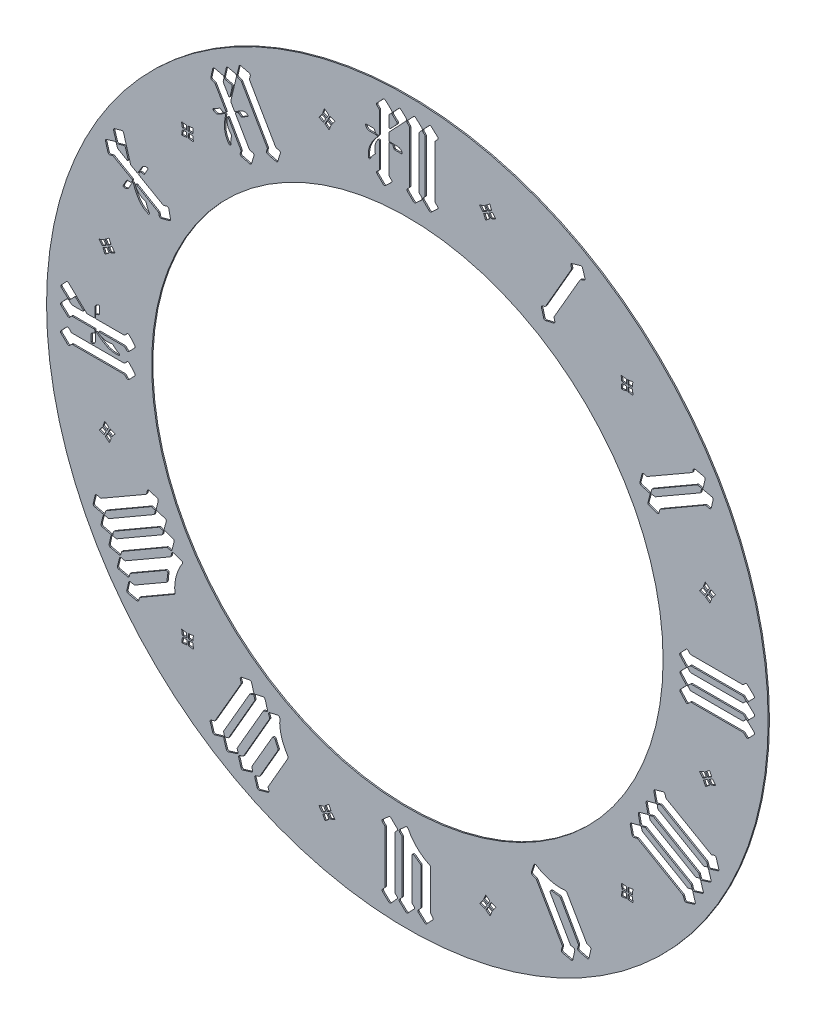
from build123d import *

# Parameters (mm, degrees)
SKETCH_2_R      = 142.5
SKETCH_2_R_2    = 101
EXTRUDE_1_DEPTH = 0.5


with BuildPart() as part:
    # Sketch 2 → Extrude 1 (new body)
    with BuildSketch(Plane.XY):
        Circle(SKETCH_2_R)
        Circle(SKETCH_2_R_2, mode=Mode.SUBTRACT)
        with BuildLine():
            Line((64.784891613, 115.462188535), (54.633225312, 97.842128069))
            ThreePointArc((54.633225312, 97.842128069), (54.460896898, 97.648808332), (54.225713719, 97.540371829))
            Line((54.225713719, 97.540371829), (53.422591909, 97.355150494))
            ThreePointArc((53.422591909, 97.355150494), (53.019703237, 97.061286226), (52.95328934, 96.567054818))
            Line((52.95328934, 96.567054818), (53.842621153, 93.352918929))
            ThreePointArc((53.842621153, 93.352918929), (54.126284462, 92.978734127), (54.589481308, 92.901741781))
            Line((54.589481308, 92.901741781), (57.750171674, 93.588649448))
            ThreePointArc((57.750171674, 93.588649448), (58.154702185, 93.874070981), (58.231353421, 94.363187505))
            Line((58.231353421, 94.363187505), (57.943178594, 95.515784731))
            ThreePointArc((57.943178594, 95.515784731), (57.93040327, 95.758236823), (58.00955213, 95.98776173))
            Line((58.00955213, 95.98776173), (68.177046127, 113.564839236))
            ThreePointArc((68.177046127, 113.564839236), (68.321134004, 113.73548853), (68.5153952, 113.845693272))
            Line((68.5153952, 113.845693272), (69.735769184, 114.276353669))
            ThreePointArc((69.735769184, 114.276353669), (70.091171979, 114.588707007), (70.131925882, 115.060103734))
            Line((70.131925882, 115.060103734), (69.188716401, 118.158225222))
            ThreePointArc((69.188716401, 118.158225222), (68.883317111, 118.531832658), (68.403479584, 118.582893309))
            Line((68.403479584, 118.582893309), (65.014635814, 117.59468894))
            ThreePointArc((65.014635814, 117.59468894), (64.633405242, 117.286323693), (64.585480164, 116.798338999))
            Line((64.585480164, 116.798338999), (64.841599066, 115.965929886))
            ThreePointArc((64.841599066, 115.965929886), (64.865692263, 115.708155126), (64.784891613, 115.462188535))
        make_face(mode=Mode.SUBTRACT)
        Polygon((89.0713, 89.1551), (87.0246, 88.8729), (87.095, 87.1088), (88.789, 87.1794), align=None, mode=Mode.SUBTRACT)
        Polygon((88.8596, 86.5443), (87.095, 86.5443), (87.095, 84.7801), (89.1419, 84.5685), align=None, mode=Mode.SUBTRACT)
        Polygon((84.4837, 84.4275), (86.5304, 84.7801), (86.4598, 86.4737), (84.6954, 86.4737), align=None, mode=Mode.SUBTRACT)
        Polygon((84.6954, 87.1088), (86.4598, 87.1088), (86.4598, 88.8729), (84.4131, 89.0845), align=None, mode=Mode.SUBTRACT)
        Polygon((32.5371, 121.7547), (30.9138, 120.4846), (31.8313, 119.0029), (33.3136, 119.8495), align=None, mode=Mode.SUBTRACT)
        Polygon((33.6665, 119.3555), (32.1136, 118.4382), (33.0313, 116.9565), (34.9369, 117.8032), align=None, mode=Mode.SUBTRACT)
        Polygon((31.6196, 118.156), (30.1375, 117.2387), (30.9138, 115.4041), (32.5371, 116.6743), align=None, mode=Mode.SUBTRACT)
        Polygon((29.7846, 117.8032), (31.3373, 118.65), (30.4198, 120.1318), (28.5142, 119.3555), align=None, mode=Mode.SUBTRACT)
        with BuildLine():
            Line((8.609940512, 136.572001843), (6.189265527, 134.009391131))
            ThreePointArc((6.189265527, 134.009391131), (6.015944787, 133.564278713), (6.201902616, 133.124295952))
            Line((6.201902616, 133.124295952), (6.871877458, 132.454426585))
            ThreePointArc((6.871877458, 132.454426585), (7.009553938, 132.248405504), (7.0579, 132.005378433))
            Line((7.0579, 132.005378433), (7.0579, 111.786321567))
            ThreePointArc((7.0579, 111.786321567), (7.009553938, 111.543294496), (6.871877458, 111.337273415))
            Line((6.871877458, 111.337273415), (6.236702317, 110.702198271))
            ThreePointArc((6.236702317, 110.702198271), (6.050679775, 110.253148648), (6.236704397, 109.804099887))
            Line((6.236704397, 109.804099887), (8.585863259, 107.455332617))
            ThreePointArc((8.585863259, 107.455332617), (9.020626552, 107.269541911), (9.46326865, 107.435690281))
            Line((9.46326865, 107.435690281), (11.880052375, 109.644862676))
            ThreePointArc((11.880052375, 109.644862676), (12.086462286, 110.099297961), (11.900661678, 110.562541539))
            Line((11.900661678, 110.562541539), (11.055160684, 111.408142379))
            ThreePointArc((11.055160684, 111.408142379), (10.917529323, 111.614142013), (10.8692, 111.857128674))
            Line((10.8692, 111.857128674), (10.8692, 132.072870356))
            ThreePointArc((10.8692, 132.072870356), (10.912800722, 132.304110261), (11.037615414, 132.503595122))
            Line((11.037615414, 132.503595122), (11.954314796, 133.496613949))
            ThreePointArc((11.954314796, 133.496613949), (12.122159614, 133.95425212), (11.916160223, 134.396031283))
            Line((11.916160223, 134.396031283), (9.499985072, 136.604647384))
            ThreePointArc((9.499985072, 136.604647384), (9.048279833, 136.770528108), (8.609940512, 136.572001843))
        make_face(mode=Mode.SUBTRACT)
        with BuildLine():
            Line((4.826766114, 132.503877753), (5.74336704, 133.496555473))
            ThreePointArc((5.74336704, 133.496555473), (5.911263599, 133.954224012), (5.705244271, 134.396044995))
            Line((5.705244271, 134.396044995), (3.288975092, 136.604568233))
            ThreePointArc((3.288975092, 136.604568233), (2.837275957, 136.770431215), (2.398949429, 136.57190542))
            Line((2.398949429, 136.57190542), (-0.021634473, 134.009391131))
            ThreePointArc((-0.021634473, 134.009391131), (-0.194955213, 133.564278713), (-0.008997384, 133.124295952))
            Line((-0.008997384, 133.124295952), (0.660977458, 132.454426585))
            ThreePointArc((0.660977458, 132.454426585), (0.798653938, 132.248405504), (0.847, 132.005378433))
            Line((0.847, 132.005378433), (0.847, 111.786321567))
            ThreePointArc((0.847, 111.786321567), (0.798653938, 111.543294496), (0.660977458, 111.337273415))
            Line((0.660977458, 111.337273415), (0.025802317, 110.702198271))
            ThreePointArc((0.025802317, 110.702198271), (-0.160220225, 110.253148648), (0.025804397, 109.804099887))
            Line((0.025804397, 109.804099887), (2.374867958, 107.455427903))
            ThreePointArc((2.374867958, 107.455427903), (2.809618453, 107.269637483), (3.252254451, 107.435768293))
            Line((3.252254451, 107.435768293), (5.669128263, 109.644844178))
            ThreePointArc((5.669128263, 109.644844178), (5.875557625, 110.099321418), (5.689703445, 110.562593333))
            Line((5.689703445, 110.562593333), (4.844313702, 111.407883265))
            ThreePointArc((4.844313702, 111.407883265), (4.70664367, 111.613901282), (4.6583, 111.856922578))
            Line((4.6583, 111.856922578), (4.6583, 132.073098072))
            ThreePointArc((4.6583, 132.073098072), (4.701914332, 132.304372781), (4.826766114, 132.503877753))
        make_face(mode=Mode.SUBTRACT)
        with BuildLine():
            Line((112.406468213, 69.805806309), (94.860870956, 59.702048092))
            ThreePointArc((94.860870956, 59.702048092), (94.631837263, 59.623435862), (94.390028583, 59.63627633))
            Line((94.390028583, 59.63627633), (93.431874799, 59.875729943))
            ThreePointArc((93.431874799, 59.875729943), (92.953997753, 59.805846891), (92.663494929, 59.420025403))
            Line((92.663494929, 59.420025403), (91.821387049, 56.193254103))
            ThreePointArc((91.821387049, 56.193254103), (91.880680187, 55.72459061), (92.247203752, 55.426561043))
            Line((92.247203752, 55.426561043), (95.403999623, 54.444634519))
            ThreePointArc((95.403999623, 54.444634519), (95.903756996, 54.497436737), (96.20863486, 54.896930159))
            Line((96.20863486, 54.896930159), (96.492988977, 56.034044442))
            ThreePointArc((96.492988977, 56.034044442), (96.601901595, 56.262168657), (96.791181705, 56.429726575))
            Line((96.791181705, 56.429726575), (114.350103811, 66.581777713))
            ThreePointArc((114.350103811, 66.581777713), (114.571329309, 66.6596543), (114.80573411, 66.651916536))
            Line((114.80573411, 66.651916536), (116.067296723, 66.371481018))
            ThreePointArc((116.067296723, 66.371481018), (116.541667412, 66.452889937), (116.822671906, 66.843647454))
            Line((116.822671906, 66.843647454), (117.586611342, 70.037864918))
            ThreePointArc((117.586611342, 70.037864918), (117.507832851, 70.52159589), (117.108087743, 70.805154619))
            Line((117.108087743, 70.805154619), (113.670719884, 71.576634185))
            ThreePointArc((113.670719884, 71.576634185), (113.193496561, 71.494514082), (112.912924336, 71.099843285))
            Line((112.912924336, 71.099843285), (112.708320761, 70.213292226))
            ThreePointArc((112.708320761, 70.213292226), (112.599836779, 69.978109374), (112.406468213, 69.805806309))
        make_face(mode=Mode.SUBTRACT)
        with BuildLine():
            Line((115.582516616, 64.442876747), (98.03692516, 54.339221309))
            ThreePointArc((98.03692516, 54.339221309), (97.807857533, 54.26060536), (97.566016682, 54.273468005))
            Line((97.566016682, 54.273468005), (96.608037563, 54.512991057))
            ThreePointArc((96.608037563, 54.512991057), (96.130122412, 54.443143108), (95.839589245, 54.057303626))
            Line((95.839589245, 54.057303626), (94.99747954, 50.830525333))
            ThreePointArc((94.99747954, 50.830525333), (95.056774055, 50.361859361), (95.423301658, 50.063830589))
            Line((95.423301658, 50.063830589), (98.579567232, 49.082099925))
            ThreePointArc((98.579567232, 49.082099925), (99.083161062, 49.137081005), (99.386278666, 49.542974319))
            Line((99.386278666, 49.542974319), (99.647139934, 50.651380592))
            ThreePointArc((99.647139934, 50.651380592), (99.755490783, 50.884548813), (99.947415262, 51.055640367))
            Line((99.947415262, 51.055640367), (117.525877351, 61.218946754))
            ThreePointArc((117.525877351, 61.218946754), (117.747055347, 61.296815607), (117.981413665, 61.28910567))
            Line((117.981413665, 61.28910567), (119.243486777, 61.008755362))
            ThreePointArc((119.243486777, 61.008755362), (119.717812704, 61.0902151), (119.998773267, 61.48096046))
            Line((119.998773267, 61.48096046), (120.762620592, 64.675204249))
            ThreePointArc((120.762620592, 64.675204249), (120.6838329, 65.158925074), (120.284092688, 65.442475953))
            Line((120.284092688, 65.442475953), (116.846731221, 66.213954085))
            ThreePointArc((116.846731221, 66.213954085), (116.369480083, 66.131816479), (116.088920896, 65.737099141))
            Line((116.088920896, 65.737099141), (115.884386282, 64.850428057))
            ThreePointArc((115.884386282, 64.850428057), (115.77590628, 64.615206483), (115.582516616, 64.442876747))
        make_face(mode=Mode.SUBTRACT)
        Polygon((117.656, 34.9634), (116.8797, 33.0582), (118.4324, 32.2115), (119.2793, 33.7639), align=None, mode=Mode.SUBTRACT)
        Polygon((118.1501, 31.7177), (116.5972, 32.5644), (115.3974, 30.8708), (117.3031, 30.1652), align=None, mode=Mode.SUBTRACT)
        Polygon((118.6441, 31.3649), (117.7972, 29.8829), (119.491, 28.6834), (120.1968, 30.518), align=None, mode=Mode.SUBTRACT)
        Polygon((118.997, 31.9293), (120.4791, 31.0826), (121.6789, 32.7054), (119.8439, 33.4817), align=None, mode=Mode.SUBTRACT)
        with BuildLine():
            Line((132.285266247, 7.3031), (111.9889233, 7.3031))
            ThreePointArc((111.9889233, 7.3031), (111.728831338, 7.358809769), (111.514376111, 7.516164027))
            Line((111.514376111, 7.516164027), (110.934058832, 8.168841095))
            ThreePointArc((110.934058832, 8.168841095), (110.468817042, 8.381836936), (109.997533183, 8.182566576))
            Line((109.997533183, 8.182566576), (107.715676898, 5.762870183))
            ThreePointArc((107.715676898, 5.762870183), (107.542677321, 5.332490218), (107.708494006, 4.899292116))
            Line((107.708494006, 4.899292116), (109.914242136, 2.480942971))
            ThreePointArc((109.914242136, 2.480942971), (110.382599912, 2.273860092), (110.851480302, 2.479756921))
            Line((110.851480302, 2.479756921), (111.591327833, 3.286802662))
            ThreePointArc((111.591327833, 3.286802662), (111.803724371, 3.438950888), (112.059404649, 3.4927))
            Line((112.059404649, 3.4927), (132.426484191, 3.4927))
            ThreePointArc((132.426484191, 3.4927), (132.669456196, 3.444376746), (132.87544805, 3.306761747))
            Line((132.87544805, 3.306761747), (133.687376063, 2.495010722))
            ThreePointArc((133.687376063, 2.495010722), (134.141074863, 2.309090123), (134.591950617, 2.501755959))
            Line((134.591950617, 2.501755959), (136.870800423, 4.84909846))
            ThreePointArc((136.870800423, 4.84909846), (137.050045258, 5.304959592), (136.851520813, 5.752761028))
            Line((136.851520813, 5.752761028), (134.291956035, 8.173541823))
            ThreePointArc((134.291956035, 8.173541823), (133.846829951, 8.347134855), (133.406682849, 8.161279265))
            Line((133.406682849, 8.161279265), (132.734208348, 7.4890165))
            ThreePointArc((132.734208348, 7.4890165), (132.528224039, 7.351417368), (132.285266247, 7.3031))
        make_face(mode=Mode.SUBTRACT)
        with BuildLine():
            Line((132.355870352, 1.0937), (112.059345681, 1.0937))
            ThreePointArc((112.059345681, 1.0937), (111.799231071, 1.149419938), (111.584765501, 1.306801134))
            Line((111.584765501, 1.306801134), (111.037041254, 1.922918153))
            ThreePointArc((111.037041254, 1.922918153), (110.57640956, 2.135866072), (110.106869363, 1.94335535))
            Line((110.106869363, 1.94335535), (107.792852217, -0.440006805))
            ThreePointArc((107.792852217, -0.440006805), (107.613609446, -0.867845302), (107.773134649, -1.303420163))
            Line((107.773134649, -1.303420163), (109.946463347, -3.756659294))
            ThreePointArc((109.946463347, -3.756659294), (110.416348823, -3.970558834), (110.889819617, -3.764717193))
            Line((110.889819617, -3.764717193), (111.662050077, -2.922464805))
            ThreePointArc((111.662050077, -2.922464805), (111.874436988, -2.770340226), (112.130097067, -2.7166))
            Line((112.130097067, -2.7166), (132.42347166, -2.7166))
            ThreePointArc((132.42347166, -2.7166), (132.654663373, -2.760181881), (132.854120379, -2.884945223))
            Line((132.854120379, -2.884945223), (133.809930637, -3.767007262))
            ThreePointArc((133.809930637, -3.767007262), (134.262621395, -3.93496981), (134.702567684, -3.736003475))
            Line((134.702567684, -3.736003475), (136.948442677, -1.354353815))
            ThreePointArc((136.948442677, -1.354353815), (137.12119454, -0.900539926), (136.922775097, -0.457346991))
            Line((136.922775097, -0.457346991), (134.362391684, 1.964099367))
            ThreePointArc((134.362391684, 1.964099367), (133.917243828, 2.137682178), (133.477093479, 1.951791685))
            Line((133.477093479, 1.951791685), (132.80484781, 1.279651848))
            ThreePointArc((132.80484781, 1.279651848), (132.59885124, 1.142026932), (132.355870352, 1.0937))
        make_face(mode=Mode.SUBTRACT)
        with BuildLine():
            Line((132.357164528, -5.1157), (112.059434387, -5.1157))
            ThreePointArc((112.059434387, -5.1157), (111.799342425, -5.059990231), (111.584887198, -4.902635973))
            Line((111.584887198, -4.902635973), (111.004703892, -4.250109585))
            ThreePointArc((111.004703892, -4.250109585), (110.539468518, -4.037113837), (110.068187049, -4.236374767))
            Line((110.068187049, -4.236374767), (107.786285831, -6.656020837))
            ThreePointArc((107.786285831, -6.656020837), (107.613277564, -7.086396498), (107.779084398, -7.519597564))
            Line((107.779084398, -7.519597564), (109.98468737, -9.937898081))
            ThreePointArc((109.98468737, -9.937898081), (110.453006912, -10.144991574), (110.921880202, -9.939154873))
            Line((110.921880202, -9.939154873), (111.662167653, -9.131837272))
            ThreePointArc((111.662167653, -9.131837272), (111.874546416, -8.979732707), (112.130189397, -8.926))
            Line((112.130189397, -8.926), (132.496889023, -8.926))
            ThreePointArc((132.496889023, -8.926), (132.739845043, -8.974316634), (132.945828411, -9.111913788))
            Line((132.945828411, -9.111913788), (133.758046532, -9.923866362))
            ThreePointArc((133.758046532, -9.923866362), (134.211738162, -10.109762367), (134.662596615, -9.91709666))
            Line((134.662596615, -9.91709666), (136.941304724, -7.569900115))
            ThreePointArc((136.941304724, -7.569900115), (137.120549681, -7.114044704), (136.922033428, -6.666245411))
            Line((136.922033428, -6.666245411), (134.328102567, -4.212873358))
            ThreePointArc((134.328102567, -4.212873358), (133.866275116, -4.039723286), (133.419824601, -4.249359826))
            Line((133.419824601, -4.249359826), (132.829103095, -4.905551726))
            ThreePointArc((132.829103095, -4.905551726), (132.615470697, -5.06078872), (132.357164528, -5.1157))
        make_face(mode=Mode.SUBTRACT)
        Polygon((117.2324, -30.0947), (115.3974, -30.9414), (116.6678, -32.4938), (118.1501, -31.6471), align=None, mode=Mode.SUBTRACT)
        Polygon((116.9501, -33.0582), (117.7972, -34.893), (119.3499, -33.6229), (118.4324, -32.1409), align=None, mode=Mode.SUBTRACT)
        Polygon((118.997, -31.8587), (119.9145, -33.3406), (121.7496, -32.4938), (120.4791, -30.9414), align=None, mode=Mode.SUBTRACT)
        Polygon((118.6441, -31.2943), (120.1968, -30.377), (119.3499, -28.5424), (117.7972, -29.8125), align=None, mode=Mode.SUBTRACT)
        with BuildLine():
            Line((119.856331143, -56.915337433), (102.2970729, -46.833558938))
            ThreePointArc((102.2970729, -46.833558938), (102.103247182, -46.661183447), (101.994520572, -46.425683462))
            Line((101.994520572, -46.425683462), (101.786267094, -45.523415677))
            ThreePointArc((101.786267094, -45.523415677), (101.490901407, -45.119729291), (100.994884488, -45.055147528))
            Line((100.994884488, -45.055147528), (97.783797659, -45.962385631))
            ThreePointArc((97.783797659, -45.962385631), (97.41201762, -46.246629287), (97.335949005, -46.708395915))
            Line((97.335949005, -46.708395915), (98.037412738, -49.934155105))
            ThreePointArc((98.037412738, -49.934155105), (98.338570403, -50.348082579), (98.847248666, -50.405339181))
            Line((98.847248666, -50.405339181), (99.870346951, -50.085745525))
            ThreePointArc((99.870346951, -50.085745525), (100.129300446, -50.060688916), (100.376568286, -50.141579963))
            Line((100.376568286, -50.141579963), (118.00332859, -60.292091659))
            ThreePointArc((118.00332859, -60.292091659), (118.185263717, -60.449429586), (118.295627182, -60.663147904))
            Line((118.295627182, -60.663147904), (118.641286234, -61.838036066))
            ThreePointArc((118.641286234, -61.838036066), (118.950735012, -62.21861867), (119.439032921, -62.265167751))
            Line((119.439032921, -62.265167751), (122.576780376, -61.289394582))
            ThreePointArc((122.576780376, -61.289394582), (122.949660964, -60.979693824), (122.995394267, -60.497135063))
            Line((122.995394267, -60.497135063), (121.962409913, -57.123298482))
            ThreePointArc((121.962409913, -57.123298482), (121.646217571, -56.744796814), (121.15449126, -56.706765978))
            Line((121.15449126, -56.706765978), (120.373252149, -56.967086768))
            ThreePointArc((120.373252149, -56.967086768), (120.109257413, -56.996493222), (119.856331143, -56.915337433))
        make_face(mode=Mode.SUBTRACT)
        with BuildLine():
            Line((97.958370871, -50.488839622), (94.681786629, -51.394935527))
            ThreePointArc((94.681786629, -51.394935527), (94.307513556, -51.678621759), (94.230538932, -52.141906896))
            Line((94.230538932, -52.141906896), (94.932008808, -55.36743611))
            ThreePointArc((94.932008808, -55.36743611), (95.233168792, -55.781355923), (95.741842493, -55.838609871))
            Line((95.741842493, -55.838609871), (96.810583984, -55.50475827))
            ThreePointArc((96.810583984, -55.50475827), (97.070084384, -55.479762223), (97.317758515, -55.561142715))
            Line((97.317758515, -55.561142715), (114.898777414, -65.725927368))
            ThreePointArc((114.898777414, -65.725927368), (115.069465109, -65.869988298), (115.179711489, -66.064239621))
            Line((115.179711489, -66.064239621), (115.617221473, -67.303334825))
            ThreePointArc((115.617221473, -67.303334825), (115.931296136, -67.659518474), (116.404591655, -67.698261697))
            Line((116.404591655, -67.698261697), (119.541929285, -66.722418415))
            ThreePointArc((119.541929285, -66.722418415), (119.914791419, -66.41269752), (119.960498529, -65.930137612))
            Line((119.960498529, -65.930137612), (118.927409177, -62.556595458))
            ThreePointArc((118.927409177, -62.556595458), (118.611221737, -62.178123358), (118.119521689, -62.140087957))
            Line((118.119521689, -62.140087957), (117.338336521, -62.40036004))
            ThreePointArc((117.338336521, -62.40036004), (117.073949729, -62.429717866), (116.820735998, -62.348200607))
            Line((116.820735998, -62.348200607), (99.178292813, -52.188772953))
            ThreePointArc((99.178292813, -52.188772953), (98.971236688, -51.997258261), (98.86754538, -51.734964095))
            Line((98.86754538, -51.734964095), (98.755248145, -51.004394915))
            ThreePointArc((98.755248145, -51.004394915), (98.472550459, -50.567720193), (97.958370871, -50.488839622))
        make_face(mode=Mode.SUBTRACT)
        with BuildLine():
            Line((95.75521403, -57.053033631), (95.649561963, -56.367005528))
            ThreePointArc((95.649561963, -56.367005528), (95.36533146, -55.92950437), (94.849311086, -55.852580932))
            Line((94.849311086, -55.852580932), (91.643318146, -56.758379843))
            ThreePointArc((91.643318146, -56.758379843), (91.271538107, -57.042623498), (91.195469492, -57.504390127))
            Line((91.195469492, -57.504390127), (91.878981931, -60.647598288))
            ThreePointArc((91.878981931, -60.647598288), (92.164391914, -61.05205573), (92.65343924, -61.128719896))
            Line((92.65343924, -61.128719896), (93.739871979, -60.857207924))
            ThreePointArc((93.739871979, -60.857207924), (93.981680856, -60.844367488), (94.210714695, -60.922979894))
            Line((94.210714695, -60.922979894), (111.86282859, -71.088091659))
            ThreePointArc((111.86282859, -71.088091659), (112.044763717, -71.245429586), (112.155127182, -71.459147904))
            Line((112.155127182, -71.459147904), (112.500786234, -72.634036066))
            ThreePointArc((112.500786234, -72.634036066), (112.810235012, -73.01461867), (113.298532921, -73.061167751))
            Line((113.298532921, -73.061167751), (116.436460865, -72.085338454))
            ThreePointArc((116.436460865, -72.085338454), (116.809345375, -71.775630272), (116.855069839, -71.293062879))
            Line((116.855069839, -71.293062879), (115.821995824, -67.919252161))
            ThreePointArc((115.821995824, -67.919252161), (115.505800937, -67.540762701), (115.014082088, -67.502735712))
            Line((115.014082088, -67.502735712), (114.23282797, -67.763061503))
            ThreePointArc((114.23282797, -67.763061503), (113.967882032, -67.792372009), (113.714250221, -67.710357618))
            Line((113.714250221, -67.710357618), (96.064977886, -57.506111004))
            ThreePointArc((96.064977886, -57.506111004), (95.858617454, -57.314767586), (95.75521403, -57.053033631))
        make_face(mode=Mode.SUBTRACT)
        with BuildLine():
            Line((111.922299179, -72.789738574), (111.089295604, -73.046040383))
            ThreePointArc((111.089295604, -73.046040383), (110.831586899, -73.070141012), (110.585669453, -72.989399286))
            Line((110.585669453, -72.989399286), (92.961178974, -62.840094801))
            ThreePointArc((92.961178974, -62.840094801), (92.767851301, -62.667844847), (92.659358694, -62.43273851))
            Line((92.659358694, -62.43273851), (92.473869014, -61.629766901))
            ThreePointArc((92.473869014, -61.629766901), (92.180002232, -61.227067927), (91.685923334, -61.160658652))
            Line((91.685923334, -61.160658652), (88.470675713, -62.049739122))
            ThreePointArc((88.470675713, -62.049739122), (88.096395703, -62.333423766), (88.019418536, -62.796713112))
            Line((88.019418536, -62.796713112), (88.706576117, -65.956430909))
            ThreePointArc((88.706576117, -65.956430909), (88.99201082, -66.360894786), (89.481082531, -66.437529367))
            Line((89.481082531, -66.437529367), (90.634424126, -66.149193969))
            ThreePointArc((90.634424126, -66.149193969), (90.87680596, -66.136413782), (91.106276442, -66.215506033))
            Line((91.106276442, -66.215506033), (108.687592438, -76.38067818))
            ThreePointArc((108.687592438, -76.38067818), (108.858266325, -76.524725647), (108.96851039, -76.718956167))
            Line((108.96851039, -76.718956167), (109.399403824, -77.939108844))
            ThreePointArc((109.399403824, -77.939108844), (109.711730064, -78.294386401), (110.183012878, -78.335158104))
            Line((110.183012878, -78.335158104), (113.28229562, -77.392113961))
            ThreePointArc((113.28229562, -77.392113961), (113.655992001, -77.08669399), (113.707034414, -76.606772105))
            Line((113.707034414, -76.606772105), (112.718626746, -73.218817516))
            ThreePointArc((112.718626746, -73.218817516), (112.410248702, -72.8376447), (111.922299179, -72.789738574))
        make_face(mode=Mode.SUBTRACT)
        Polygon((86.4598, -84.7097), (84.4837, -84.4979), (84.766, -86.4737), (86.5304, -86.4737), align=None, mode=Mode.SUBTRACT)
        Polygon((86.5304, -87.0381), (84.766, -87.1088), (84.5542, -89.0845), (86.5304, -88.8023), align=None, mode=Mode.SUBTRACT)
        Polygon((87.1656, -88.8023), (89.1419, -89.0139), (88.8596, -87.0381), (87.095, -87.0381), align=None, mode=Mode.SUBTRACT)
        Polygon((87.095, -86.4033), (88.8596, -86.4033), (89.0713, -84.3569), (87.095, -84.7097), align=None, mode=Mode.SUBTRACT)
        Polygon((32.5371, -116.6036), (30.9138, -115.4041), (30.1375, -117.2387), (31.6902, -118.0856), align=None, mode=Mode.SUBTRACT)
        Polygon((29.8552, -117.8034), (28.6552, -119.4263), (30.5609, -120.2024), (31.4079, -118.65), align=None, mode=Mode.SUBTRACT)
        Polygon((31.9019, -118.9323), (31.055, -120.4846), (32.6784, -121.6841), (33.4546, -119.7789), align=None, mode=Mode.SUBTRACT)
        Polygon((32.1842, -118.4384), (33.7369, -119.2851), (34.9369, -117.5915), (33.0313, -116.8859), align=None, mode=Mode.SUBTRACT)
        Polygon((-30.9844, -115.3335), (-32.5371, -116.6036), (-31.6196, -118.1562), (-30.1375, -117.2387), align=None, mode=Mode.SUBTRACT)
        Polygon((-33.1017, -116.9565), (-34.9367, -117.7327), (-33.6663, -119.3557), (-32.1842, -118.4384), align=None, mode=Mode.SUBTRACT)
        Polygon((-31.8313, -118.9323), (-33.384, -119.8495), (-32.5371, -121.7547), (-30.9844, -120.4846), align=None, mode=Mode.SUBTRACT)
        Polygon((-31.3373, -118.65), (-30.4198, -120.1318), (-28.5846, -119.3557), (-29.855, -117.7327), align=None, mode=Mode.SUBTRACT)
        Polygon((-87.1656, -84.7803), (-89.1419, -84.4979), (-88.8596, -86.5443), (-87.095, -86.4737), align=None, mode=Mode.SUBTRACT)
        Polygon((-88.8596, -87.1088), (-89.0713, -89.1551), (-87.095, -88.8729), (-87.095, -87.1088), align=None, mode=Mode.SUBTRACT)
        Polygon((-86.4598, -87.1088), (-86.4598, -88.8729), (-84.4131, -89.0845), (-84.766, -87.0381), align=None, mode=Mode.SUBTRACT)
        Polygon((-86.4598, -86.4737), (-84.766, -86.4737), (-84.4835, -84.4275), (-86.5304, -84.7097), align=None, mode=Mode.SUBTRACT)
        Polygon((-118.7147, -31.3649), (-117.8676, -29.8125), (-119.491, -28.6128), (-120.1968, -30.518), align=None, mode=Mode.SUBTRACT)
        Polygon((-117.3031, -30.1654), (-118.1499, -31.6471), (-116.6678, -32.4938), (-115.3974, -30.8708), align=None, mode=Mode.SUBTRACT)
        Polygon((-119.8439, -33.411), (-118.997, -31.9293), (-120.5498, -31.0826), (-121.7496, -32.7056), align=None, mode=Mode.SUBTRACT)
        Polygon((-118.4324, -32.2115), (-119.2793, -33.6933), (-117.656, -34.9634), (-116.9501, -33.0582), align=None, mode=Mode.SUBTRACT)
        Polygon((-120.4791, 30.9414), (-118.997, 31.8587), (-119.9145, 33.3404), (-121.7496, 32.5644), align=None, mode=Mode.SUBTRACT)
        Polygon((-118.7147, 31.2943), (-120.1968, 30.4476), (-119.4204, 28.5424), (-117.7972, 29.8125), align=None, mode=Mode.SUBTRACT)
        Polygon((-118.1499, 31.6471), (-117.3031, 30.1652), (-115.3974, 30.9414), (-116.6678, 32.5644), align=None, mode=Mode.SUBTRACT)
        Polygon((-118.5029, 32.1409), (-117.0208, 33.0582), (-117.7972, 34.893), (-119.4204, 33.6933), align=None, mode=Mode.SUBTRACT)
        Polygon((-87.1656, 88.8023), (-89.2125, 89.0139), (-88.8596, 87.0381), (-87.1656, 87.0381), align=None, mode=Mode.SUBTRACT)
        Polygon((-88.8596, 86.4031), (-89.1419, 84.4275), (-87.095, 84.7097), (-87.1656, 86.4737), align=None, mode=Mode.SUBTRACT)
        Polygon((-86.6011, 88.8023), (-86.5304, 87.1088), (-84.766, 87.1088), (-84.5542, 89.1551), align=None, mode=Mode.SUBTRACT)
        Polygon((-86.5304, 86.4737), (-86.4598, 84.7097), (-84.4835, 84.4979), (-84.766, 86.4737), align=None, mode=Mode.SUBTRACT)
        Polygon((-31.055, 120.4846), (-32.7488, 121.6841), (-33.4546, 119.7789), (-31.9019, 118.9323), align=None, mode=Mode.SUBTRACT)
        Polygon((-33.7369, 119.2851), (-34.9367, 117.6621), (-33.1017, 116.8859), (-32.2548, 118.4382), align=None, mode=Mode.SUBTRACT)
        Polygon((-31.6902, 118.156), (-32.5371, 116.6036), (-30.9138, 115.4041), (-30.1375, 117.3093), align=None, mode=Mode.SUBTRACT)
        Polygon((-31.4079, 118.65), (-29.855, 117.8032), (-28.6552, 119.4261), (-30.5609, 120.2024), align=None, mode=Mode.SUBTRACT)
        with BuildLine():
            Line((-65.564338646, 114.621051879), (-55.398791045, 97.047539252))
            ThreePointArc((-55.398791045, 97.047539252), (-55.316712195, 96.793834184), (-55.34603221, 96.528799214))
            Line((-55.34603221, 96.528799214), (-55.605988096, 95.748839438))
            ThreePointArc((-55.605988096, 95.748839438), (-55.560956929, 95.243849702), (-55.160608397, 94.932781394))
            Line((-55.160608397, 94.932781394), (-51.92821292, 94.107752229))
            ThreePointArc((-51.92821292, 94.107752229), (-51.461398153, 94.168711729), (-51.164849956, 94.534349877))
            Line((-51.164849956, 94.534349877), (-50.18809123, 97.673204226))
            ThreePointArc((-50.18809123, 97.673204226), (-50.240878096, 98.17304727), (-50.640466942, 98.477937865))
            Line((-50.640466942, 98.477937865), (-51.695248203, 98.741516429))
            ThreePointArc((-51.695248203, 98.741516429), (-51.923378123, 98.850381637), (-52.090964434, 99.039616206))
            Line((-52.090964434, 99.039616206), (-62.25765899, 116.615111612))
            ThreePointArc((-62.25765899, 116.615111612), (-62.336181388, 116.840282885), (-62.326109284, 117.078539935))
            Line((-62.326109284, 117.078539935), (-62.037660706, 118.304165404))
            ThreePointArc((-62.037660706, 118.304165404), (-62.115246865, 118.782888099), (-62.508113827, 119.067230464))
            Line((-62.508113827, 119.067230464), (-65.718258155, 119.83473825))
            ThreePointArc((-65.718258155, 119.83473825), (-66.196712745, 119.759177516), (-66.48268448, 119.368219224))
            Line((-66.48268448, 119.368219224), (-67.33309271, 115.896396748))
            ThreePointArc((-67.33309271, 115.896396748), (-67.257023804, 115.412349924), (-66.859013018, 115.126561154))
            Line((-66.859013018, 115.126561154), (-65.971313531, 114.921856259))
            ThreePointArc((-65.971313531, 114.921856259), (-65.736565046, 114.813748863), (-65.564338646, 114.621051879))
        make_face(mode=Mode.SUBTRACT)
        with BuildLine():
            Line((-111.988804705, -4.904), (-132.355889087, -4.904))
            ThreePointArc((-132.355889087, -4.904), (-132.598845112, -4.855683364), (-132.804828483, -4.718086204))
            Line((-132.804828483, -4.718086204), (-133.651164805, -3.872026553))
            ThreePointArc((-133.651164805, -3.872026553), (-134.109455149, -3.686181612), (-134.562073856, -3.885441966))
            Line((-134.562073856, -3.885441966), (-136.807421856, -6.266328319))
            ThreePointArc((-136.807421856, -6.266328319), (-136.980192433, -6.720160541), (-136.781755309, -7.163371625))
            Line((-136.781755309, -7.163371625), (-134.221278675, -9.584720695))
            ThreePointArc((-134.221278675, -9.584720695), (-133.776136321, -9.758286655), (-133.335998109, -9.572396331))
            Line((-133.335998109, -9.572396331), (-132.66384781, -8.900351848))
            ThreePointArc((-132.66384781, -8.900351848), (-132.45785124, -8.762726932), (-132.214870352, -8.7144))
            Line((-132.214870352, -8.7144), (-111.990129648, -8.7144))
            ThreePointArc((-111.990129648, -8.7144), (-111.74714876, -8.762726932), (-111.54115219, -8.900351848))
            Line((-111.54115219, -8.900351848), (-110.87043174, -9.570966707))
            ThreePointArc((-110.87043174, -9.570966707), (-110.416728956, -9.756900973), (-109.965843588, -9.564235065))
            Line((-109.965843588, -9.564235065), (-107.651832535, -7.180674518))
            ThreePointArc((-107.651832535, -7.180674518), (-107.4726086, -6.752849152), (-107.632124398, -6.317291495))
            Line((-107.632124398, -6.317291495), (-109.805353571, -3.864052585))
            ThreePointArc((-109.805353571, -3.864052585), (-110.275261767, -3.650142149), (-110.748746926, -3.856013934))
            Line((-110.748746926, -3.856013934), (-111.520730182, -4.698105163))
            ThreePointArc((-111.520730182, -4.698105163), (-111.733125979, -4.850251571), (-111.988804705, -4.904))
        make_face(mode=Mode.SUBTRACT)
        with BuildLine():
            Line((-103.285288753, -45.493087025), (-120.892630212, -55.632301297))
            ThreePointArc((-120.892630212, -55.632301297), (-121.129841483, -55.712000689), (-121.379425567, -55.693863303))
            Line((-121.379425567, -55.693863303), (-122.513188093, -55.379008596))
            ThreePointArc((-122.513188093, -55.379008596), (-123.005508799, -55.443789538), (-123.300674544, -55.843105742))
            Line((-123.300674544, -55.843105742), (-124.067820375, -59.049706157))
            ThreePointArc((-124.067820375, -59.049706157), (-123.991523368, -59.529487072), (-123.598413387, -59.814926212))
            Line((-123.598413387, -59.814926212), (-120.18850327, -60.63315004))
            ThreePointArc((-120.18850327, -60.63315004), (-119.711064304, -60.55863621), (-119.424301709, -60.169704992))
            Line((-119.424301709, -60.169704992), (-119.197918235, -59.264278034))
            ThreePointArc((-119.197918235, -59.264278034), (-119.089006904, -59.036141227), (-118.899720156, -58.868574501))
            Line((-118.899720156, -58.868574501), (-101.34057123, -48.716392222))
            ThreePointArc((-101.34057123, -48.716392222), (-101.094247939, -48.635162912), (-100.835993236, -48.659201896))
            Line((-100.835993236, -48.659201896), (-99.958718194, -48.929125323))
            ThreePointArc((-99.958718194, -48.929125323), (-99.455805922, -48.872894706), (-99.153690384, -48.466928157))
            Line((-99.153690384, -48.466928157), (-98.397316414, -45.235555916))
            ThreePointArc((-98.397316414, -45.235555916), (-98.463419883, -44.777276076), (-98.823113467, -44.485710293))
            Line((-98.823113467, -44.485710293), (-101.893407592, -43.50904119))
            ThreePointArc((-101.893407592, -43.50904119), (-102.395285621, -43.559631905), (-102.701935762, -43.960139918))
            Line((-102.701935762, -43.960139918), (-102.98613272, -45.096827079))
            ThreePointArc((-102.98613272, -45.096827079), (-103.095376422, -45.325407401), (-103.285288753, -45.493087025))
        make_face(mode=Mode.SUBTRACT)
        with BuildLine():
            Line((-100.158249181, -50.843497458), (-117.737958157, -61.007566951))
            ThreePointArc((-117.737958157, -61.007566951), (-117.963061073, -61.08602817), (-118.20123339, -61.075956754))
            Line((-118.20123339, -61.075956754), (-119.427702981, -60.787381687))
            ThreePointArc((-119.427702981, -60.787381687), (-119.906367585, -60.864961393), (-120.190712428, -61.257754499))
            Line((-120.190712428, -61.257754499), (-120.958475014, -64.466932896))
            ThreePointArc((-120.958475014, -64.466932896), (-120.882936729, -64.945473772), (-120.491893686, -65.231468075))
            Line((-120.491893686, -65.231468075), (-117.018912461, -66.081662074))
            ThreePointArc((-117.018912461, -66.081662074), (-116.515136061, -65.992859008), (-116.240303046, -65.561415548))
            Line((-116.240303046, -65.561415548), (-116.124358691, -64.807653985))
            ThreePointArc((-116.124358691, -64.807653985), (-116.020970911, -64.54585529), (-115.814579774, -64.354464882))
            Line((-115.814579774, -64.354464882), (-98.165356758, -54.150146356))
            ThreePointArc((-98.165356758, -54.150146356), (-97.91169038, -54.068127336), (-97.646712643, -54.097462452))
            Line((-97.646712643, -54.097462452), (-96.866472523, -54.357542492))
            ThreePointArc((-96.866472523, -54.357542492), (-96.361503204, -54.312541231), (-96.050411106, -53.912240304))
            Line((-96.050411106, -53.912240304), (-95.225240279, -50.68083276))
            ThreePointArc((-95.225240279, -50.68083276), (-95.286184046, -50.213943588), (-95.651898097, -49.917375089))
            Line((-95.651898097, -49.917375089), (-98.791800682, -48.940734))
            ThreePointArc((-98.791800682, -48.940734), (-99.291589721, -48.993558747), (-99.596449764, -49.393108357))
            Line((-99.596449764, -49.393108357), (-99.860037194, -50.447738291))
            ThreePointArc((-99.860037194, -50.447738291), (-99.968945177, -50.675907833), (-100.158249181, -50.843497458))
        make_face(mode=Mode.SUBTRACT)
        with BuildLine():
            Line((-96.40428605, -54.691546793), (-96.672115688, -55.762770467))
            ThreePointArc((-96.672115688, -55.762770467), (-96.78102629, -55.990909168), (-96.970313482, -56.158477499))
            Line((-96.970313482, -56.158477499), (-114.612476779, -66.35871428))
            ThreePointArc((-114.612476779, -66.35871428), (-114.833679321, -66.436587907), (-115.068061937, -66.42886422))
            Line((-115.068061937, -66.42886422), (-116.34481194, -66.145153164))
            ThreePointArc((-116.34481194, -66.145153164), (-116.825878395, -66.23084601), (-117.103648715, -66.63285577))
            Line((-117.103648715, -66.63285577), (-117.790451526, -69.86008944))
            ThreePointArc((-117.790451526, -69.86008944), (-117.703915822, -70.335013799), (-117.308436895, -70.611849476))
            Line((-117.308436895, -70.611849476), (-113.885823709, -71.380116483))
            ThreePointArc((-113.885823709, -71.380116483), (-113.408562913, -71.297987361), (-113.127996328, -70.903265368))
            Line((-113.127996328, -70.903265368), (-112.938762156, -70.082922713))
            ThreePointArc((-112.938762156, -70.082922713), (-112.830610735, -69.848145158), (-112.637849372, -69.675923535))
            Line((-112.637849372, -69.675923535), (-95.059888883, -59.512864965))
            ThreePointArc((-95.059888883, -59.512864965), (-94.806245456, -59.430848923), (-94.541288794, -59.460167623))
            Line((-94.541288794, -59.460167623), (-93.760920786, -59.720228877))
            ThreePointArc((-93.760920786, -59.720228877), (-93.255990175, -59.675211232), (-92.944910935, -59.274947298))
            Line((-92.944910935, -59.274947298), (-92.119492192, -56.04333207))
            ThreePointArc((-92.119492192, -56.04333207), (-92.176303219, -55.583905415), (-92.529904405, -55.28513034))
            Line((-92.529904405, -55.28513034), (-95.583413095, -54.244514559))
            ThreePointArc((-95.583413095, -54.244514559), (-96.09194458, -54.287901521), (-96.40428605, -54.691546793))
        make_face(mode=Mode.SUBTRACT)
        with BuildLine():
            Line((-111.751000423, -72.285557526), (-112.961752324, -72.016607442))
            ThreePointArc((-112.961752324, -72.016607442), (-113.436054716, -72.098052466), (-113.717025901, -72.488758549))
            Line((-113.717025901, -72.488758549), (-114.484687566, -75.697712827))
            ThreePointArc((-114.484687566, -75.697712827), (-114.405198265, -76.182630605), (-114.003486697, -76.465635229))
            Line((-114.003486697, -76.465635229), (-110.562508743, -77.222279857))
            ThreePointArc((-110.562508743, -77.222279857), (-110.086863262, -77.138864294), (-109.807428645, -76.745020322))
            Line((-109.807428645, -76.745020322), (-109.621324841, -75.939390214))
            ThreePointArc((-109.621324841, -75.939390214), (-109.512907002, -75.70438481), (-109.319722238, -75.532159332))
            Line((-109.319722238, -75.532159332), (-95.551745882, -67.596426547))
            ThreePointArc((-95.551745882, -67.596426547), (-94.869307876, -67.627200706), (-94.609685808, -68.259074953))
            ThreePointArc((-94.609685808, -68.259074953), (-94.809976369, -69.628666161), (-94.919824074, -71.008459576))
            ThreePointArc((-94.919824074, -71.008459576), (-95.011791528, -71.309188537), (-95.23677565, -71.528911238))
            Line((-95.23677565, -71.528911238), (-107.575267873, -78.648363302))
            ThreePointArc((-107.575267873, -78.648363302), (-107.800141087, -78.726585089), (-108.038016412, -78.716488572))
            Line((-108.038016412, -78.716488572), (-109.280404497, -78.424271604))
            ThreePointArc((-109.280404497, -78.424271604), (-109.759045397, -78.501878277), (-110.043367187, -78.894664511))
            Line((-110.043367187, -78.894664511), (-110.811138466, -82.104076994))
            ThreePointArc((-110.811138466, -82.104076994), (-110.732369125, -82.587843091), (-110.332589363, -82.871410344))
            Line((-110.332589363, -82.871410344), (-106.827862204, -83.657805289))
            ThreePointArc((-106.827862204, -83.657805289), (-106.350658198, -83.57566822), (-106.070100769, -83.181006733))
            Line((-106.070100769, -83.181006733), (-105.862000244, -82.279303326))
            ThreePointArc((-105.862000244, -82.279303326), (-105.753933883, -82.044684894), (-105.56136382, -81.872519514))
            Line((-105.56136382, -81.872519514), (-92.143421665, -74.10613831))
            ThreePointArc((-92.143421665, -74.10613831), (-91.898550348, -73.850308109), (-91.8287743, -73.503116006))
            ThreePointArc((-91.8287743, -73.503116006), (-91.327966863, -67.51502903), (-88.884089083, -62.025452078))
            ThreePointArc((-88.884089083, -62.025452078), (-88.813910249, -61.463343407), (-89.220457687, -61.068868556))
            Line((-89.220457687, -61.068868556), (-92.278205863, -60.096159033))
            ThreePointArc((-92.278205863, -60.096159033), (-92.780098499, -60.146752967), (-93.086746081, -60.547281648))
            Line((-93.086746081, -60.547281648), (-93.366632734, -61.666927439))
            ThreePointArc((-93.366632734, -61.666927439), (-93.475873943, -61.895521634), (-93.665792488, -62.063211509))
            Line((-93.665792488, -62.063211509), (-111.296417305, -72.215948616))
            ThreePointArc((-111.296417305, -72.215948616), (-111.517185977, -72.293350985), (-111.751000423, -72.285557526))
        make_face(mode=Mode.SUBTRACT)
        with BuildLine():
            Line((-65.703068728, -91.542909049), (-75.870342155, -109.119605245))
            ThreePointArc((-75.870342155, -109.119605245), (-76.027595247, -109.300889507), (-76.240896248, -109.410867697))
            Line((-76.240896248, -109.410867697), (-77.416099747, -109.756377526))
            ThreePointArc((-77.416099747, -109.756377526), (-77.795872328, -110.064138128), (-77.844461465, -110.550536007))
            Line((-77.844461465, -110.550536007), (-76.887403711, -113.694144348))
            ThreePointArc((-76.887403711, -113.694144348), (-76.583537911, -114.066919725), (-76.105519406, -114.119780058))
            Line((-76.105519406, -114.119780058), (-72.711210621, -113.150187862))
            ThreePointArc((-72.711210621, -113.150187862), (-72.327448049, -112.842372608), (-72.278713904, -112.352833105))
            Line((-72.278713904, -112.352833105), (-72.548927, -111.474808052))
            ThreePointArc((-72.548927, -111.474808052), (-72.572971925, -111.216467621), (-72.49167973, -110.97007461))
            Line((-72.49167973, -110.97007461), (-62.325694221, -93.395777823))
            ThreePointArc((-62.325694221, -93.395777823), (-62.153473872, -93.203085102), (-61.918733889, -93.094976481))
            Line((-61.918733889, -93.094976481), (-61.097433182, -92.905562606))
            ThreePointArc((-61.097433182, -92.905562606), (-60.693639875, -92.610174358), (-60.62908537, -92.114053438))
            Line((-60.62908537, -92.114053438), (-61.536577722, -88.904105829))
            ThreePointArc((-61.536577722, -88.904105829), (-61.820804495, -88.532420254), (-62.282483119, -88.456342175))
            Line((-62.282483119, -88.456342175), (-65.509299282, -89.157620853))
            ThreePointArc((-65.509299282, -89.157620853), (-65.923321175, -89.458826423), (-65.980514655, -89.967616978))
            Line((-65.980514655, -89.967616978), (-65.646661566, -91.035473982))
            ThreePointArc((-65.646661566, -91.035473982), (-65.621619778, -91.295110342), (-65.703068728, -91.542909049))
        make_face(mode=Mode.SUBTRACT)
        with BuildLine():
            Line((-60.338132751, -94.575786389), (-70.505635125, -112.223306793))
            ThreePointArc((-70.505635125, -112.223306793), (-70.663005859, -112.405203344), (-70.876738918, -112.515521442))
            Line((-70.876738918, -112.515521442), (-72.052050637, -112.861063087))
            ThreePointArc((-72.052050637, -112.861063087), (-72.43275252, -113.170552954), (-72.479257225, -113.658974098))
            Line((-72.479257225, -113.658974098), (-71.49698451, -116.815228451))
            ThreePointArc((-71.49698451, -116.815228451), (-71.185676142, -117.188846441), (-70.701336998, -117.232651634))
            Line((-70.701336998, -117.232651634), (-67.332694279, -116.180398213))
            ThreePointArc((-67.332694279, -116.180398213), (-66.956770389, -115.863610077), (-66.919633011, -115.373411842))
            Line((-66.919633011, -115.373411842), (-67.179899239, -114.592889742))
            ThreePointArc((-67.179899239, -114.592889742), (-67.20925227, -114.327814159), (-67.127168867, -114.074064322))
            Line((-67.127168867, -114.074064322), (-56.920413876, -96.429315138))
            ThreePointArc((-56.920413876, -96.429315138), (-56.729054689, -96.223016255), (-56.467338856, -96.119660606))
            Line((-56.467338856, -96.119660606), (-55.780847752, -96.014012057))
            ThreePointArc((-55.780847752, -96.014012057), (-55.34326739, -95.729752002), (-55.266387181, -95.213641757))
            Line((-55.266387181, -95.213641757), (-56.172485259, -92.008777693))
            ThreePointArc((-56.172485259, -92.008777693), (-56.456713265, -91.637097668), (-56.918388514, -91.561021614))
            Line((-56.918388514, -91.561021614), (-60.062664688, -92.244362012))
            ThreePointArc((-60.062664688, -92.244362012), (-60.467202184, -92.529794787), (-60.543840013, -93.01892575))
            Line((-60.543840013, -93.01892575), (-60.272315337, -94.104735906))
            ThreePointArc((-60.272315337, -94.104735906), (-60.259455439, -94.346656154), (-60.338132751, -94.575786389))
        make_face(mode=Mode.SUBTRACT)
        with BuildLine():
            Line((-51.167569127, -94.95639569), (-54.289971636, -95.649869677))
            ThreePointArc((-54.289971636, -95.649869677), (-54.701905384, -95.951718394), (-54.758356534, -96.459276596))
            Line((-54.758356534, -96.459276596), (-54.438771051, -97.481316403))
            ThreePointArc((-54.438771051, -97.481316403), (-54.413657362, -97.740420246), (-54.494618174, -97.987828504))
            Line((-54.494618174, -97.987828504), (-64.64748067, -115.610038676))
            ThreePointArc((-64.64748067, -115.610038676), (-64.808661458, -115.794912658), (-65.027882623, -115.904911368))
            Line((-65.027882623, -115.904911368), (-66.190183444, -116.227483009))
            ThreePointArc((-66.190183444, -116.227483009), (-66.574750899, -116.529698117), (-66.630414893, -117.015627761))
            Line((-66.630414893, -117.015627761), (-65.713202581, -120.189932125))
            ThreePointArc((-65.713202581, -120.189932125), (-65.403871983, -120.572942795), (-64.913779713, -120.619763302))
            Line((-64.913779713, -120.619763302), (-61.545074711, -119.567198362))
            ThreePointArc((-61.545074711, -119.567198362), (-61.169187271, -119.250402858), (-61.132061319, -118.760226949))
            Line((-61.132061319, -118.760226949), (-61.392297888, -117.979793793))
            ThreePointArc((-61.392297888, -117.979793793), (-61.421622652, -117.714440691), (-61.339287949, -117.460485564))
            Line((-61.339287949, -117.460485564), (-53.367294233, -103.706934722))
            ThreePointArc((-53.367294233, -103.706934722), (-52.761392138, -103.392894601), (-52.22077197, -103.809389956))
            ThreePointArc((-52.22077197, -103.809389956), (-51.704412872, -105.101732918), (-51.10378812, -106.357132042))
            ThreePointArc((-51.10378812, -106.357132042), (-51.032387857, -106.664016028), (-51.117289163, -106.967442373))
            Line((-51.117289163, -106.967442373), (-58.225118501, -119.280108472))
            ThreePointArc((-58.225118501, -119.280108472), (-58.373554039, -119.454590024), (-58.574243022, -119.565047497))
            Line((-58.574243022, -119.565047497), (-59.844046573, -119.988348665))
            ThreePointArc((-59.844046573, -119.988348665), (-60.207416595, -120.299354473), (-60.250704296, -120.775682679))
            Line((-60.250704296, -120.775682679), (-59.307611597, -123.873734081))
            ThreePointArc((-59.307611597, -123.873734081), (-59.00222035, -124.247351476), (-58.522381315, -124.298422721))
            Line((-58.522381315, -124.298422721), (-55.133428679, -123.310257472))
            ThreePointArc((-55.133428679, -123.310257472), (-54.752180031, -123.001877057), (-54.704272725, -122.513866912))
            Line((-54.704272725, -122.513866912), (-54.960405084, -121.681595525))
            ThreePointArc((-54.960405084, -121.681595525), (-54.984514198, -121.423823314), (-54.903729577, -121.177852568))
            Line((-54.903729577, -121.177852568), (-47.125889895, -107.675980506))
            ThreePointArc((-47.125889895, -107.675980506), (-47.041761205, -107.330575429), (-47.15646006, -106.994084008))
            ThreePointArc((-47.15646006, -106.994084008), (-49.738188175, -101.577288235), (-50.395946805, -95.612864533))
            ThreePointArc((-50.395946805, -95.612864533), (-50.618421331, -95.092642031), (-51.167569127, -94.95639569))
        make_face(mode=Mode.SUBTRACT)
        with BuildLine():
            Line((-7.338088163, -107.710930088), (-9.792045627, -109.883771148))
            ThreePointArc((-9.792045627, -109.883771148), (-10.005800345, -110.339999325), (-9.819997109, -110.808307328))
            Line((-9.819997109, -110.808307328), (-8.937993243, -111.689894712))
            ThreePointArc((-8.937993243, -111.689894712), (-8.800265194, -111.895940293), (-8.7519, -112.139013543))
            Line((-8.7519, -112.139013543), (-8.7519, -132.355411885))
            ThreePointArc((-8.7519, -132.355411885), (-8.795521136, -132.586703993), (-8.920391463, -132.786219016))
            Line((-8.920391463, -132.786219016), (-9.802299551, -133.741211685))
            ThreePointArc((-9.802299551, -133.741211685), (-9.970409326, -134.194032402), (-9.771326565, -134.634115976))
            Line((-9.771326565, -134.634115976), (-7.3890099, -136.879495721))
            ThreePointArc((-7.3890099, -136.879495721), (-6.930711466, -137.05199044), (-6.485949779, -136.847102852))
            Line((-6.485949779, -136.847102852), (-4.10191572, -134.253238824))
            ThreePointArc((-4.10191572, -134.253238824), (-3.93515145, -133.793490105), (-4.144625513, -133.351562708))
            Line((-4.144625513, -133.351562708), (-4.730414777, -132.824302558))
            ThreePointArc((-4.730414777, -132.824302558), (-4.885678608, -132.610659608), (-4.9406, -132.352330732))
            Line((-4.9406, -132.352330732), (-4.9406, -112.068521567))
            ThreePointArc((-4.9406, -112.068521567), (-4.892253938, -111.825494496), (-4.754577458, -111.619473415))
            Line((-4.754577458, -111.619473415), (-4.084003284, -110.949004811))
            ThreePointArc((-4.084003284, -110.949004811), (-3.89799845, -110.495214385), (-4.090760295, -110.044252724))
            Line((-4.090760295, -110.044252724), (-6.474912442, -107.730643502))
            ThreePointArc((-6.474912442, -107.730643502), (-6.902634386, -107.551512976), (-7.338088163, -107.710930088))
        make_face(mode=Mode.SUBTRACT)
        with BuildLine():
            Line((-3.058450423, -134.710594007), (-0.641643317, -136.919519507))
            ThreePointArc((-0.641643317, -136.919519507), (-0.190216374, -137.085383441), (0.248002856, -136.887239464))
            Line((0.248002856, -136.887239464), (2.634880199, -134.364697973))
            ThreePointArc((2.634880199, -134.364697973), (2.808574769, -133.91946344), (2.622613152, -133.479211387))
            Line((2.622613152, -133.479211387), (1.950522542, -132.807226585))
            ThreePointArc((1.950522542, -132.807226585), (1.812846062, -132.601205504), (1.7645, -132.358178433))
            Line((1.7645, -132.358178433), (1.7645, -116.480096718))
            ThreePointArc((1.7645, -116.480096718), (2.132350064, -115.904027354), (2.809715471, -115.995382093))
            ThreePointArc((2.809715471, -115.995382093), (3.912540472, -116.867208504), (5.071097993, -117.663480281))
            ThreePointArc((5.071097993, -117.663480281), (5.286053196, -117.893510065), (5.3641, -118.198515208))
            Line((5.3641, -118.198515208), (5.3641, -132.431474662))
            ThreePointArc((5.3641, -132.431474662), (5.320150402, -132.663604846), (5.194385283, -132.863602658))
            Line((5.194385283, -132.863602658), (4.315662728, -133.80974981))
            ThreePointArc((4.315662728, -133.80974981), (4.1464788, -134.267835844), (4.352517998, -134.710570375))
            Line((4.352517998, -134.710570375), (6.76913595, -136.919591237))
            ThreePointArc((6.76913595, -136.919591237), (7.220572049, -137.085481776), (7.658810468, -136.887337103))
            Line((7.658810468, -136.887337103), (10.045780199, -134.364697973))
            ThreePointArc((10.045780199, -134.364697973), (10.219474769, -133.91946344), (10.033513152, -133.479211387))
            Line((10.033513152, -133.479211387), (9.361422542, -132.807226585))
            ThreePointArc((9.361422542, -132.807226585), (9.223746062, -132.601205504), (9.1754, -132.358178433))
            Line((9.1754, -132.358178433), (9.1754, -116.819914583))
            ThreePointArc((9.1754, -116.819914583), (9.075875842, -116.478607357), (8.808500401, -116.244286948))
            ThreePointArc((8.808500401, -116.244286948), (3.868626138, -112.840809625), (0.321496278, -108.003053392))
            ThreePointArc((0.321496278, -108.003053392), (-0.130321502, -107.663575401), (-0.673770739, -107.818648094))
            Line((-0.673770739, -107.818648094), (-3.023395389, -109.960313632))
            ThreePointArc((-3.023395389, -109.960313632), (-3.230463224, -110.414999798), (-3.044538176, -110.878732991))
            Line((-3.044538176, -110.878732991), (-2.232893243, -111.689994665))
            ThreePointArc((-2.232893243, -111.689994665), (-2.095165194, -111.896040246), (-2.0468, -112.139113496))
            Line((-2.0468, -112.139113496), (-2.0468, -132.431471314))
            ThreePointArc((-2.0468, -132.431471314), (-2.090755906, -132.663617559), (-2.216538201, -132.863624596))
            Line((-2.216538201, -132.863624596), (-3.095310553, -133.809722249))
            ThreePointArc((-3.095310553, -133.809722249), (-3.264517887, -134.267835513), (-3.058450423, -134.710594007))
        make_face(mode=Mode.SUBTRACT)
        with BuildLine():
            Line((49.950967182, -95.564048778), (48.95699921, -98.544142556))
            ThreePointArc((48.95699921, -98.544142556), (48.991416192, -99.029039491), (49.35868569, -99.347508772))
            Line((49.35868569, -99.347508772), (50.614638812, -99.765896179))
            ThreePointArc((50.614638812, -99.765896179), (50.814495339, -99.875613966), (50.962716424, -100.048851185))
            Line((50.962716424, -100.048851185), (61.127411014, -117.50775277))
            ThreePointArc((61.127411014, -117.50775277), (61.209234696, -117.752559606), (61.186864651, -118.009707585))
            Line((61.186864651, -118.009707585), (60.829278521, -119.201717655))
            ThreePointArc((60.829278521, -119.201717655), (60.888164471, -119.70269541), (61.29369689, -120.00267828))
            Line((61.29369689, -120.00267828), (64.585281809, -120.767981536))
            ThreePointArc((64.585281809, -120.767981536), (65.068238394, -120.686321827), (65.349401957, -120.285245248))
            Line((65.349401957, -120.285245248), (66.099057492, -116.860068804))
            ThreePointArc((66.099057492, -116.860068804), (66.018390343, -116.389633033), (65.632828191, -116.108281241))
            Line((65.632828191, -116.108281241), (64.70653696, -115.876585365))
            ThreePointArc((64.70653696, -115.876585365), (64.477904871, -115.767270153), (64.310229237, -115.577250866))
            Line((64.310229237, -115.577250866), (56.428470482, -101.878919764))
            ThreePointArc((56.428470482, -101.878919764), (56.459744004, -101.196530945), (57.091771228, -100.937351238))
            ThreePointArc((57.091771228, -100.937351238), (58.513030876, -101.144357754), (59.945098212, -101.253965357))
            ThreePointArc((59.945098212, -101.253965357), (60.249068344, -101.346369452), (60.470231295, -101.574455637))
            Line((60.470231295, -101.574455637), (67.45851993, -113.861061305))
            ThreePointArc((67.45851993, -113.861061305), (67.53413633, -114.078220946), (67.527456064, -114.308072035))
            Line((67.527456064, -114.308072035), (67.266305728, -115.526609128))
            ThreePointArc((67.266305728, -115.526609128), (67.350221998, -115.998605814), (67.740198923, -116.277426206))
            Line((67.740198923, -116.277426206), (70.980249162, -117.048471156))
            ThreePointArc((70.980249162, -117.048471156), (71.465380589, -116.968213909), (71.747756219, -116.565649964))
            Line((71.747756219, -116.565649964), (72.48664281, -113.167692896))
            ThreePointArc((72.48664281, -113.167692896), (72.409114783, -112.703512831), (72.033356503, -112.420176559))
            Line((72.033356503, -112.420176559), (71.161700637, -112.182248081))
            ThreePointArc((71.161700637, -112.182248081), (70.941493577, -112.072780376), (70.779390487, -111.887856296))
            Line((70.779390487, -111.887856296), (63.009073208, -98.468582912))
            ThreePointArc((63.009073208, -98.468582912), (62.752390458, -98.223335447), (62.404177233, -98.154198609))
            ThreePointArc((62.404177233, -98.154198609), (56.406515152, -97.669612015), (50.903683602, -95.235352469))
            ThreePointArc((50.903683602, -95.235352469), (50.34624275, -95.164685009), (49.950967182, -95.564048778))
        make_face(mode=Mode.SUBTRACT)
        with BuildLine():
            Line((-6.249358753, 134.354961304), (-8.670120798, 136.63287458))
            ThreePointArc((-8.670120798, 136.63287458), (-9.123956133, 136.805149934), (-9.566878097, 136.60649082))
            Line((-9.566878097, 136.60649082), (-12.020177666, 134.009559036))
            ThreePointArc((-12.020177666, 134.009559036), (-12.19305823, 133.547725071), (-11.983296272, 133.101431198))
            Line((-11.983296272, 133.101431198), (-11.291384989, 132.478916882))
            ThreePointArc((-11.291384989, 132.478916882), (-11.136048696, 132.265245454), (-11.0811, 132.006855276))
            Line((-11.0811, 132.006855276), (-11.0811, 123.5539))
            ThreePointArc((-11.0811, 123.5539), (-11.174093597, 123.329393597), (-11.3986, 123.2364))
            Line((-11.3986, 123.2364), (-11.993038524, 123.2364))
            ThreePointArc((-11.993038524, 123.2364), (-12.311765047, 123.322183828), (-12.544376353, 123.556357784))
            Line((-12.544376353, 123.556357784), (-13.116969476, 124.558421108))
            ThreePointArc((-13.116969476, 124.558421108), (-13.233275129, 124.675508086), (-13.392638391, 124.7184))
            Line((-13.392638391, 124.7184), (-16.197079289, 124.7184))
            ThreePointArc((-16.197079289, 124.7184), (-16.447277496, 124.596366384), (-16.505144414, 124.324074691))
            Line((-16.505144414, 124.324074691), (-16.475437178, 124.20495036))
            ThreePointArc((-16.475437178, 124.20495036), (-15.89027836, 123.303957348), (-14.874468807, 122.9542))
            Line((-14.874468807, 122.9542), (-12.127785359, 122.9542))
            ThreePointArc((-12.127785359, 122.9542), (-11.836125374, 122.762161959), (-11.897283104, 122.418354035))
            ThreePointArc((-11.897283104, 122.418354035), (-13.439123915, 120.496398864), (-14.645519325, 118.347958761))
            ThreePointArc((-14.645519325, 118.347958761), (-15.337218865, 115.972766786), (-15.3157, 113.499))
            Line((-15.3157, 113.499), (-14.7511, 113.499))
            ThreePointArc((-14.7511, 113.499), (-13.824629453, 115.009358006), (-12.6338, 116.3214))
            ThreePointArc((-12.6338, 116.3214), (-12.784897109, 119.117228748), (-11.650875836, 121.677206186))
            ThreePointArc((-11.650875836, 121.677206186), (-11.296843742, 121.785180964), (-11.0811, 121.484428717))
            Line((-11.0811, 121.484428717), (-11.0811, 111.784844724))
            ThreePointArc((-11.0811, 111.784844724), (-11.136048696, 111.526454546), (-11.291384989, 111.312783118))
            Line((-11.291384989, 111.312783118), (-11.946181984, 110.72366062))
            ThreePointArc((-11.946181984, 110.72366062), (-12.156351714, 110.263697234), (-11.963858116, 109.796060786))
            Line((-11.963858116, 109.796060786), (-9.546799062, 107.448759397))
            ThreePointArc((-9.546799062, 107.448759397), (-9.109409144, 107.26931732), (-8.669247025, 107.441847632))
            Line((-8.669247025, 107.441847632), (-6.322102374, 109.650487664))
            ThreePointArc((-6.322102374, 109.650487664), (-6.122336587, 110.10328839), (-6.308250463, 110.561950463))
            Line((-6.308250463, 110.561950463), (-7.083812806, 111.337512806))
            ThreePointArc((-7.083812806, 111.337512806), (-7.221463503, 111.543521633), (-7.2698, 111.786525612))
            Line((-7.2698, 111.786525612), (-7.2698, 122.6367))
            ThreePointArc((-7.2698, 122.6367), (-7.176806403, 122.861206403), (-6.9523, 122.9542))
            Line((-6.9523, 122.9542), (-6.246067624, 122.9542))
            ThreePointArc((-6.246067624, 122.9542), (-5.893839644, 122.847556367), (-5.659919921, 122.563445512))
            Line((-5.659919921, 122.563445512), (-5.286740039, 121.667877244))
            ThreePointArc((-5.286740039, 121.667877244), (-5.169780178, 121.525821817), (-4.993666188, 121.4725))
            Line((-4.993666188, 121.4725), (-2.348832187, 121.4725))
            ThreePointArc((-2.348832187, 121.4725), (-2.078738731, 121.623099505), (-2.064871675, 121.93203055))
            Line((-2.064871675, 121.93203055), (-2.192074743, 122.186346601))
            ThreePointArc((-2.192074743, 122.186346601), (-2.892591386, 122.952707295), (-3.891366, 123.2364))
            Line((-3.891366, 123.2364), (-6.9523, 123.2364))
            ThreePointArc((-6.9523, 123.2364), (-7.176806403, 123.329393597), (-7.2698, 123.5539))
            Line((-7.2698, 123.5539), (-7.2698, 126.281263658))
            ThreePointArc((-7.2698, 126.281263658), (-7.247430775, 126.398328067), (-7.183475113, 126.498897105))
            Line((-7.183475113, 126.498897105), (-0.436156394, 133.666049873))
            ThreePointArc((-0.436156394, 133.666049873), (-0.263839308, 134.121869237), (-0.465286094, 134.565584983))
            Line((-0.465286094, 134.565584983), (-2.53209807, 136.494180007))
            ThreePointArc((-2.53209807, 136.494180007), (-2.989673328, 136.66444457), (-3.432851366, 136.459607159))
            Line((-3.432851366, 136.459607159), (-5.850189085, 133.829407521))
            ThreePointArc((-5.850189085, 133.829407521), (-6.017072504, 133.37248901), (-5.811661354, 132.931545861))
            Line((-5.811661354, 132.931545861), (-4.210634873, 131.464442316))
            ThreePointArc((-4.210634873, 131.464442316), (-4.005026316, 131.01842519), (-4.179038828, 130.559158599))
            Line((-4.179038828, 130.559158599), (-6.721999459, 127.879580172))
            ThreePointArc((-6.721999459, 127.879580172), (-7.069955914, 127.803243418), (-7.2698, 128.098138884))
            Line((-7.2698, 128.098138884), (-7.2698, 132.146364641))
            ThreePointArc((-7.2698, 132.146364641), (-7.221450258, 132.389400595), (-7.083763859, 132.595426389))
            Line((-7.083763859, 132.595426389), (-6.235555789, 133.443449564))
            ThreePointArc((-6.235555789, 133.443449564), (-6.049592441, 133.902125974), (-6.249358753, 134.354961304))
        make_face(mode=Mode.SUBTRACT)
        with BuildLine():
            Line((-67.96322145, 116.124584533), (-70.749295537, 116.75133278))
            ThreePointArc((-70.749295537, 116.75133278), (-71.22827524, 116.668365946), (-71.508228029, 116.270959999))
            Line((-71.508228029, 116.270959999), (-72.279905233, 112.834934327))
            ThreePointArc((-72.279905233, 112.834934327), (-72.197006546, 112.356360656), (-71.800132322, 112.076368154))
            Line((-71.800132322, 112.076368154), (-69.659986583, 111.593368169))
            ThreePointArc((-69.659986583, 111.593368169), (-69.262108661, 111.311783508), (-69.181049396, 110.831131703))
            Line((-69.181049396, 110.831131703), (-70.018077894, 107.20479889))
            ThreePointArc((-70.018077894, 107.20479889), (-70.280175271, 106.962244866), (-70.602070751, 107.116876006))
            Line((-70.602070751, 107.116876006), (-72.632325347, 110.616285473))
            ThreePointArc((-72.632325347, 110.616285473), (-72.710611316, 110.837897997), (-72.702925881, 111.072805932))
            Line((-72.702925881, 111.072805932), (-72.42608104, 112.317578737))
            ThreePointArc((-72.42608104, 112.317578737), (-72.507466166, 112.792002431), (-72.898266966, 113.073029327))
            Line((-72.898266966, 113.073029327), (-76.09346864, 113.837015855))
            ThreePointArc((-76.09346864, 113.837015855), (-76.577142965, 113.758242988), (-76.860704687, 113.358569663))
            Line((-76.860704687, 113.358569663), (-77.628821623, 109.9383967))
            ThreePointArc((-77.628821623, 109.9383967), (-77.546771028, 109.461167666), (-77.152148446, 109.180538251))
            Line((-77.152148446, 109.180538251), (-76.346049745, 108.994366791))
            ThreePointArc((-76.346049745, 108.994366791), (-76.111921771, 108.88661262), (-75.939904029, 108.694683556))
            Line((-75.939904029, 108.694683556), (-71.649245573, 101.310609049))
            ThreePointArc((-71.649245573, 101.310609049), (-71.619570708, 101.060144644), (-71.781855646, 100.867073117))
            Line((-71.781855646, 100.867073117), (-72.378685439, 100.568869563))
            ThreePointArc((-72.378685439, 100.568869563), (-72.690474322, 100.502527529), (-72.99521491, 100.59605157))
            Line((-72.99521491, 100.59605157), (-73.87226445, 101.135568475))
            ThreePointArc((-73.87226445, 101.135568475), (-74.033471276, 101.182596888), (-74.196118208, 101.140820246))
            Line((-74.196118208, 101.140820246), (-76.602620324, 99.765968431))
            ThreePointArc((-76.602620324, 99.765968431), (-76.75980026, 99.532518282), (-76.669733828, 99.265886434))
            Line((-76.669733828, 99.265886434), (-76.572517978, 99.168578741))
            ThreePointArc((-76.572517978, 99.168578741), (-75.614410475, 98.698065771), (-74.568766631, 98.912498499))
            Line((-74.568766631, 98.912498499), (-72.255261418, 100.273145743))
            ThreePointArc((-72.255261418, 100.273145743), (-71.904609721, 100.254072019), (-71.786018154, 99.92353237))
            ThreePointArc((-71.786018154, 99.92353237), (-72.168288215, 97.596625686), (-72.181161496, 95.23856305))
            ThreePointArc((-72.181161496, 95.23856305), (-71.603483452, 92.722395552), (-70.2971, 90.4957))
            Line((-70.2971, 90.4957), (-69.7325, 90.7781))
            ThreePointArc((-69.7325, 90.7781), (-69.716722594, 92.523249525), (-69.3796, 94.2356))
            ThreePointArc((-69.3796, 94.2356), (-70.913744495, 96.588809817), (-71.224506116, 99.38069502))
            ThreePointArc((-71.224506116, 99.38069502), (-70.972366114, 99.653061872), (-70.634163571, 99.500165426))
            Line((-70.634163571, 99.500165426), (-65.773266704, 91.048592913))
            ThreePointArc((-65.773266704, 91.048592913), (-65.691893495, 90.795436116), (-65.721317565, 90.531155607))
            Line((-65.721317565, 90.531155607), (-65.981370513, 89.751181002))
            ThreePointArc((-65.981370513, 89.751181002), (-65.936376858, 89.246156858), (-65.536012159, 88.935058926))
            Line((-65.536012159, 88.935058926), (-62.303619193, 88.110030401))
            ThreePointArc((-62.303619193, 88.110030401), (-61.836812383, 88.170985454), (-61.540261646, 88.53661064))
            Line((-61.540261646, 88.53661064), (-60.563411, 91.675442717))
            ThreePointArc((-60.563411, 91.675442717), (-60.616178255, 92.175277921), (-61.015742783, 92.48018414))
            Line((-61.015742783, 92.48018414), (-62.070741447, 92.7438871))
            ThreePointArc((-62.070741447, 92.7438871), (-62.298729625, 92.852664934), (-62.46626981, 93.041719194))
            Line((-62.46626981, 93.041719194), (-67.886717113, 102.402079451))
            ThreePointArc((-67.886717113, 102.402079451), (-67.91799126, 102.64575369), (-67.766037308, 102.838795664))
            Line((-67.766037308, 102.838795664), (-67.128572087, 103.192597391))
            ThreePointArc((-67.128572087, 103.192597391), (-66.767090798, 103.270136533), (-66.423686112, 103.133190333))
            Line((-66.423686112, 103.133190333), (-65.680648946, 102.538634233))
            ThreePointArc((-65.680648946, 102.538634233), (-65.50292916, 102.469711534), (-65.317767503, 102.514986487))
            Line((-65.317767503, 102.514986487), (-63.04104462, 103.894294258))
            ThreePointArc((-63.04104462, 103.894294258), (-62.888323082, 104.178777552), (-63.063690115, 104.449888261))
            Line((-63.063690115, 104.449888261), (-63.525590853, 104.680593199))
            ThreePointArc((-63.525590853, 104.680593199), (-64.424834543, 104.880155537), (-65.31226543, 104.633313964))
            Line((-65.31226543, 104.633313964), (-67.981697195, 103.118570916))
            ThreePointArc((-67.981697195, 103.118570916), (-68.223839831, 103.088926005), (-68.415536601, 103.239804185))
            Line((-68.415536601, 103.239804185), (-69.707404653, 105.551101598))
            ThreePointArc((-69.707404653, 105.551101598), (-69.744684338, 105.661933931), (-69.7393146, 105.778744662))
            Line((-69.7393146, 105.778744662), (-67.484474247, 115.35959477))
            ThreePointArc((-67.484474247, 115.35959477), (-67.564306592, 115.841934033), (-67.96322145, 116.124584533))
        make_face(mode=Mode.SUBTRACT)
        with BuildLine():
            Line((-112.840177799, 74.200603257), (-115.592774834, 73.424304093))
            ThreePointArc((-115.592774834, 73.424304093), (-115.977864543, 73.117237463), (-116.02758605, 72.627225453))
            Line((-116.02758605, 72.627225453), (-115.000302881, 69.272326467))
            ThreePointArc((-115.000302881, 69.272326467), (-114.695106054, 68.899644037), (-114.216135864, 68.848410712))
            Line((-114.216135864, 68.848410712), (-112.087261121, 69.466279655))
            ThreePointArc((-112.087261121, 69.466279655), (-111.605217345, 69.413373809), (-111.301082, 69.035661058))
            Line((-111.301082, 69.035661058), (-110.257434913, 65.488128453))
            ThreePointArc((-110.257434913, 65.488128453), (-110.36593401, 65.148813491), (-110.721298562, 65.123858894))
            Line((-110.721298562, 65.123858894), (-114.193546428, 67.137349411))
            ThreePointArc((-114.193546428, 67.137349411), (-114.363793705, 67.281320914), (-114.473780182, 67.475266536))
            Line((-114.473780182, 67.475266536), (-114.904546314, 68.695346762))
            ThreePointArc((-114.904546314, 68.695346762), (-115.216867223, 69.050658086), (-115.688171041, 69.091440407))
            Line((-115.688171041, 69.091440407), (-118.78739562, 68.148413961))
            ThreePointArc((-118.78739562, 68.148413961), (-119.161092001, 67.84299399), (-119.212134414, 67.363072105))
            Line((-119.212134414, 67.363072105), (-118.223769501, 63.975264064))
            ThreePointArc((-118.223769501, 63.975264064), (-117.915419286, 63.594106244), (-117.427502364, 63.546166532))
            Line((-117.427502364, 63.546166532), (-116.594419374, 63.802401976))
            ThreePointArc((-116.594419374, 63.802401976), (-116.337824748, 63.826601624), (-116.092747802, 63.746828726))
            Line((-116.092747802, 63.746828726), (-108.733530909, 59.542554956))
            ThreePointArc((-108.733530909, 59.542554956), (-108.587138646, 59.358839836), (-108.607096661, 59.124780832))
            Line((-108.607096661, 59.124780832), (-108.870181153, 58.599077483))
            ThreePointArc((-108.870181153, 58.599077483), (-109.122467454, 58.33222586), (-109.48029725, 58.249666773))
            Line((-109.48029725, 58.249666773), (-110.523579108, 58.319245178))
            ThreePointArc((-110.523579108, 58.319245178), (-110.694829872, 58.282215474), (-110.820364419, 58.159989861))
            Line((-110.820364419, 58.159989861), (-112.207445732, 55.732941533))
            ThreePointArc((-112.207445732, 55.732941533), (-112.223768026, 55.450684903), (-112.008562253, 55.267322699))
            Line((-112.008562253, 55.267322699), (-111.853750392, 55.228743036))
            ThreePointArc((-111.853750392, 55.228743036), (-110.799440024, 55.315496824), (-110.014504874, 56.024702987))
            Line((-110.014504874, 56.024702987), (-108.704576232, 58.368138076))
            ThreePointArc((-108.704576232, 58.368138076), (-108.391712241, 58.528706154), (-108.122671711, 58.302248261))
            ThreePointArc((-108.122671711, 58.302248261), (-107.232258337, 55.986085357), (-105.9721834, 53.84840958))
            ThreePointArc((-105.9721834, 53.84840958), (-104.270949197, 52.062265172), (-102.1285, 50.8398))
            Line((-102.1285, 50.8398), (-101.7756, 51.3339))
            ThreePointArc((-101.7756, 51.3339), (-102.652280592, 52.882552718), (-103.1873, 54.5798))
            ThreePointArc((-103.1873, 54.5798), (-105.699117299, 55.847562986), (-107.356830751, 58.120982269))
            ThreePointArc((-107.356830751, 58.120982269), (-107.272482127, 58.481774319), (-106.903634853, 58.516949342))
            Line((-106.903634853, 58.516949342), (-98.463300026, 53.594815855))
            ThreePointArc((-98.463300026, 53.594815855), (-98.271905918, 53.4228576), (-98.164454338, 53.189072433))
            Line((-98.164454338, 53.189072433), (-97.97915181, 52.386153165))
            ThreePointArc((-97.97915181, 52.386153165), (-97.685309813, 51.983358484), (-97.191171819, 51.916918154))
            Line((-97.191171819, 51.916918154), (-93.975943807, 52.806020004))
            ThreePointArc((-93.975943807, 52.806020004), (-93.601672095, 53.089697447), (-93.5246874, 53.55297443))
            Line((-93.5246874, 53.55297443), (-94.211747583, 56.71269198))
            ThreePointArc((-94.211747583, 56.71269198), (-94.497144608, 57.117148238), (-94.986180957, 57.193827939))
            Line((-94.986180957, 57.193827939), (-96.139481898, 56.905655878))
            ThreePointArc((-96.139481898, 56.905655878), (-96.380194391, 56.892673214), (-96.608400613, 56.970345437))
            Line((-96.608400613, 56.970345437), (-105.969076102, 62.31789257))
            ThreePointArc((-105.969076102, 62.31789257), (-106.115452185, 62.501545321), (-106.095571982, 62.735551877))
            Line((-106.095571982, 62.735551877), (-105.758729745, 63.409331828))
            ThreePointArc((-105.758729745, 63.409331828), (-105.482443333, 63.689423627), (-105.094185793, 63.752997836))
            Line((-105.094185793, 63.752997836), (-104.140812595, 63.606309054))
            ThreePointArc((-104.140812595, 63.606309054), (-103.955062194, 63.633918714), (-103.817402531, 63.761650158))
            Line((-103.817402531, 63.761650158), (-102.50519269, 66.039891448))
            ThreePointArc((-102.50519269, 66.039891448), (-102.491115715, 66.32938216), (-102.718035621, 66.509688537))
            Line((-102.718035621, 66.509688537), (-102.805973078, 66.527281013))
            ThreePointArc((-102.805973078, 66.527281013), (-103.957893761, 66.397071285), (-104.819746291, 65.621773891))
            Line((-104.819746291, 65.621773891), (-106.372394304, 62.960914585))
            ThreePointArc((-106.372394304, 62.960914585), (-106.562985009, 62.814644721), (-106.801464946, 62.84374814))
            Line((-106.801464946, 62.84374814), (-109.167745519, 64.165623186))
            ThreePointArc((-109.167745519, 64.165623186), (-109.261307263, 64.245064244), (-109.317747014, 64.354056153))
            Line((-109.317747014, 64.354056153), (-112.058128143, 73.766942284))
            ThreePointArc((-112.058128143, 73.766942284), (-112.359872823, 74.144777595), (-112.840177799, 74.200603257))
        make_face(mode=Mode.SUBTRACT)
        with BuildLine():
            Line((-128.232051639, 4.6924), (-132.28236937, 4.6924))
            ThreePointArc((-132.28236937, 4.6924), (-132.513527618, 4.7359688), (-132.712965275, 4.86069649))
            Line((-132.712965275, 4.86069649), (-133.668832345, 5.742610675))
            ThreePointArc((-133.668832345, 5.742610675), (-134.121479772, 5.910524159), (-134.561380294, 5.711596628))
            Line((-134.561380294, 5.711596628), (-136.807338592, 3.330255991))
            ThreePointArc((-136.807338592, 3.330255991), (-136.97997975, 2.871840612), (-136.774989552, 2.426948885))
            Line((-136.774989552, 2.426948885), (-134.180438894, 0.043320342))
            ThreePointArc((-134.180438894, 0.043320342), (-133.72072524, -0.123347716), (-133.278867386, 0.086119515))
            Line((-133.278867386, 0.086119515), (-132.75159022, 0.671918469))
            ThreePointArc((-132.75159022, 0.671918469), (-132.537948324, 0.827179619), (-132.279621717, 0.8821))
            Line((-132.279621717, 0.8821), (-123.761, 0.8821))
            ThreePointArc((-123.761, 0.8821), (-123.536493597, 0.789106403), (-123.4435, 0.5646))
            Line((-123.4435, 0.5646), (-123.4435, -0.030546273))
            ThreePointArc((-123.4435, -0.030546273), (-123.53337508, -0.356220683), (-123.777559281, -0.589706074))
            Line((-123.777559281, -0.589706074), (-124.75857036, -1.11768784))
            ThreePointArc((-124.75857036, -1.11768784), (-124.88066246, -1.234430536), (-124.9256, -1.397267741))
            Line((-124.9256, -1.397267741), (-124.9256, -4.162204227))
            ThreePointArc((-124.9256, -4.162204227), (-124.803566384, -4.412402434), (-124.531274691, -4.470269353))
            Line((-124.531274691, -4.470269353), (-124.41195036, -4.44051224))
            ThreePointArc((-124.41195036, -4.44051224), (-123.510957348, -3.855353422), (-123.1612, -2.839543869))
            Line((-123.1612, -2.839543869), (-123.1612, -0.09378677))
            ThreePointArc((-123.1612, -0.09378677), (-122.969183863, 0.197863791), (-122.62538866, 0.136748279))
            ThreePointArc((-122.62538866, 0.136748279), (-120.70131258, -1.406078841), (-118.550435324, -2.612773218))
            ThreePointArc((-118.550435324, -2.612773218), (-116.176046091, -3.303240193), (-113.7034, -3.2811))
            Line((-113.7034, -3.2811), (-113.7034, -2.7166))
            ThreePointArc((-113.7034, -2.7166), (-115.177335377, -1.785096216), (-116.4562, -0.5999))
            ThreePointArc((-116.4562, -0.5999), (-119.279306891, -0.803148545), (-121.881468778, 0.310402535))
            ThreePointArc((-121.881468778, 0.310402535), (-121.992491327, 0.664846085), (-121.691232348, 0.8821))
            Line((-121.691232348, 0.8821), (-111.990329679, 0.8821))
            ThreePointArc((-111.990329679, 0.8821), (-111.747348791, 0.833773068), (-111.541352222, 0.696148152))
            Line((-111.541352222, 0.696148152), (-110.870431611, 0.025333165))
            ThreePointArc((-110.870431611, 0.025333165), (-110.4167156, -0.160601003), (-109.965825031, 0.03208379))
            Line((-109.965825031, 0.03208379), (-107.651813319, 2.415843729))
            ThreePointArc((-107.651813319, 2.415843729), (-107.47260722, 2.843676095), (-107.632140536, 3.279226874))
            Line((-107.632140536, 3.279226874), (-109.805370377, 5.732267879))
            ThreePointArc((-109.805370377, 5.732267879), (-110.275255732, 5.946159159), (-110.748721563, 5.740314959))
            Line((-110.748721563, 5.740314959), (-111.520756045, 4.898267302))
            ThreePointArc((-111.520756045, 4.898267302), (-111.733143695, 4.746140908), (-111.988805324, 4.6924))
            Line((-111.988805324, 4.6924), (-122.8437, 4.6924))
            ThreePointArc((-122.8437, 4.6924), (-123.068206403, 4.785393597), (-123.1612, 5.0099))
            Line((-123.1612, 5.0099), (-123.1612, 5.716403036))
            ThreePointArc((-123.1612, 5.716403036), (-123.049589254, 6.0759704), (-122.753991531, 6.30913908))
            Line((-122.753991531, 6.30913908), (-121.812104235, 6.671111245))
            ThreePointArc((-121.812104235, 6.671111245), (-121.664305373, 6.787695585), (-121.6085, 6.967479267))
            Line((-121.6085, 6.967479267), (-121.6085, 9.682467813))
            ThreePointArc((-121.6085, 9.682467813), (-121.759099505, 9.952561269), (-122.06803055, 9.966428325))
            Line((-122.06803055, 9.966428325), (-122.393446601, 9.803662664))
            ThreePointArc((-122.393446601, 9.803662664), (-123.159807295, 9.103146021), (-123.4435, 8.104371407))
            Line((-123.4435, 8.104371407), (-123.4435, 5.0099))
            ThreePointArc((-123.4435, 5.0099), (-123.536493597, 4.785393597), (-123.761, 4.6924))
            Line((-123.761, 4.6924), (-126.415025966, 4.6924))
            ThreePointArc((-126.415025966, 4.6924), (-126.532780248, 4.7150438), (-126.633738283, 4.77974533))
            Line((-126.633738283, 4.77974533), (-133.805551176, 11.595004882))
            ThreePointArc((-133.805551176, 11.595004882), (-134.261967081, 11.769411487), (-134.707139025, 11.568028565))
            Line((-134.707139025, 11.568028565), (-136.668597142, 9.467019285))
            ThreePointArc((-136.668597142, 9.467019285), (-136.838966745, 9.009332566), (-136.634017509, 8.566050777))
            Line((-136.634017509, 8.566050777), (-134.037801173, 6.181090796))
            ThreePointArc((-134.037801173, 6.181090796), (-133.5877462, 6.014056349), (-133.149390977, 6.209746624))
            Line((-133.149390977, 6.209746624), (-131.629464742, 7.798391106))
            ThreePointArc((-131.629464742, 7.798391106), (-131.186052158, 7.994224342), (-130.733657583, 7.820142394))
            Line((-130.733657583, 7.820142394), (-128.013561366, 5.240265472))
            ThreePointArc((-128.013561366, 5.240265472), (-127.937138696, 4.892287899), (-128.232051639, 4.6924))
        make_face(mode=Mode.SUBTRACT)
    extrude(amount=EXTRUDE_1_DEPTH)


solid = part.part
